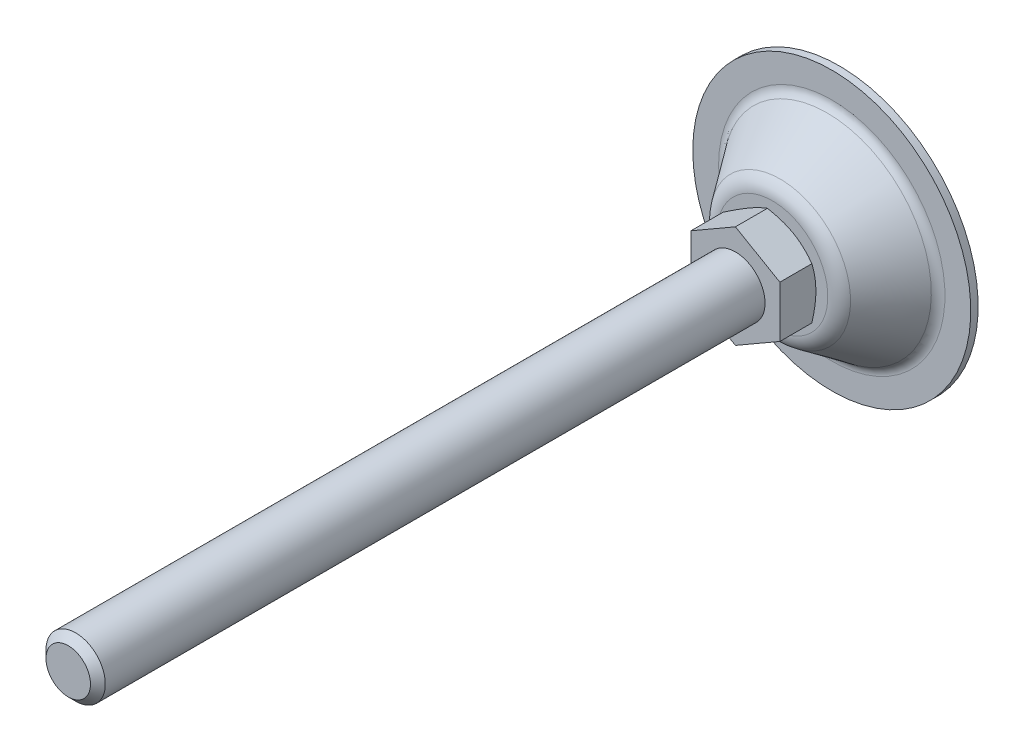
ISO-10303-21;
HEADER;
FILE_DESCRIPTION(('STEP AP214'),'2;1');
FILE_NAME('part.step','',(''),(''),'','','');
FILE_SCHEMA(('AUTOMOTIVE_DESIGN { 1 0 10303 214 1 1 1 1 }'));
ENDSEC;
DATA;
#1=APPLICATION_CONTEXT('core data for automotive mechanical design processes');
#2=APPLICATION_PROTOCOL_DEFINITION('international standard','automotive_design',2000,#1);
#3=PRODUCT_CONTEXT('',#1,'mechanical');
#4=PRODUCT('Part','Part','',(#3));
#5=PRODUCT_RELATED_PRODUCT_CATEGORY('part','',(#4));
#6=PRODUCT_DEFINITION_FORMATION('','',#4);
#7=PRODUCT_DEFINITION_CONTEXT('part definition',#1,'design');
#8=PRODUCT_DEFINITION('design','',#6,#7);
#9=PRODUCT_DEFINITION_SHAPE('','',#8);
#10=(LENGTH_UNIT() NAMED_UNIT(*) SI_UNIT(.MILLI.,.METRE.));
#11=(NAMED_UNIT(*) PLANE_ANGLE_UNIT() SI_UNIT($,.RADIAN.));
#12=(NAMED_UNIT(*) SI_UNIT($,.STERADIAN.) SOLID_ANGLE_UNIT());
#13=UNCERTAINTY_MEASURE_WITH_UNIT(LENGTH_MEASURE(1.E-05),#10,'distance_accuracy_value','');
#14=(GEOMETRIC_REPRESENTATION_CONTEXT(3) GLOBAL_UNCERTAINTY_ASSIGNED_CONTEXT((#13)) GLOBAL_UNIT_ASSIGNED_CONTEXT((#10,
#11,#12)) REPRESENTATION_CONTEXT('',''));
#15=CARTESIAN_POINT('',(0.,0.,0.));
#16=DIRECTION('',(0.,0.,1.));
#17=DIRECTION('',(1.,0.,0.));
#18=AXIS2_PLACEMENT_3D('',#15,#16,#17);
#19=CARTESIAN_POINT('',(0.,0.,28.));
#20=DIRECTION('',(0.,0.,1.));
#21=DIRECTION('',(0.5,-0.866025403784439,0.));
#22=AXIS2_PLACEMENT_3D('',#19,#20,#21);
#23=PLANE('',#22);
#24=DIRECTION('',(0.,1.,0.));
#25=VECTOR('',#24,1.);
#26=CARTESIAN_POINT('',(12.,-6.92820323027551,28.));
#27=LINE('',#26,#25);
#28=CARTESIAN_POINT('',(12.,-6.92820323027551,28.));
#29=VERTEX_POINT('',#28);
#30=CARTESIAN_POINT('',(12.,6.9282032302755,28.));
#31=VERTEX_POINT('',#30);
#32=EDGE_CURVE('E220',#29,#31,#27,.T.);
#33=ORIENTED_EDGE('',*,*,#32,.T.);
#34=DIRECTION('',(-0.866025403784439,0.5,0.));
#35=VECTOR('',#34,1.);
#36=CARTESIAN_POINT('',(12.,6.9282032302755,28.));
#37=LINE('',#36,#35);
#38=CARTESIAN_POINT('',(0.,13.856406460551,28.));
#39=VERTEX_POINT('',#38);
#40=EDGE_CURVE('E361',#31,#39,#37,.T.);
#41=ORIENTED_EDGE('',*,*,#40,.T.);
#42=DIRECTION('',(-0.866025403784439,-0.5,0.));
#43=VECTOR('',#42,1.);
#44=CARTESIAN_POINT('',(0.,13.856406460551,28.));
#45=LINE('',#44,#43);
#46=CARTESIAN_POINT('',(-12.,6.92820323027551,28.));
#47=VERTEX_POINT('',#46);
#48=EDGE_CURVE('E360',#39,#47,#45,.T.);
#49=ORIENTED_EDGE('',*,*,#48,.T.);
#50=DIRECTION('',(0.,-1.,0.));
#51=VECTOR('',#50,1.);
#52=CARTESIAN_POINT('',(-12.,6.92820323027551,28.));
#53=LINE('',#52,#51);
#54=CARTESIAN_POINT('',(-12.,-6.9282032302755,28.));
#55=VERTEX_POINT('',#54);
#56=EDGE_CURVE('E365',#47,#55,#53,.T.);
#57=ORIENTED_EDGE('',*,*,#56,.T.);
#58=DIRECTION('',(0.866025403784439,-0.5,0.));
#59=VECTOR('',#58,1.);
#60=CARTESIAN_POINT('',(-12.,-6.9282032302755,28.));
#61=LINE('',#60,#59);
#62=CARTESIAN_POINT('',(0.,-13.856406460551,28.));
#63=VERTEX_POINT('',#62);
#64=EDGE_CURVE('E367',#55,#63,#61,.T.);
#65=ORIENTED_EDGE('',*,*,#64,.T.);
#66=DIRECTION('',(0.866025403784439,0.5,0.));
#67=VECTOR('',#66,1.);
#68=CARTESIAN_POINT('',(0.,-13.856406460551,28.));
#69=LINE('',#68,#67);
#70=EDGE_CURVE('E37',#63,#29,#69,.T.);
#71=ORIENTED_EDGE('',*,*,#70,.T.);
#72=EDGE_LOOP('',(#33,#41,#49,#57,#65,#71));
#73=FACE_BOUND('',#72,.T.);
#74=CARTESIAN_POINT('',(0.,0.,28.));
#75=DIRECTION('',(0.,0.,1.));
#76=DIRECTION('',(0.5,-0.866025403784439,0.));
#77=AXIS2_PLACEMENT_3D('',#74,#75,#76);
#78=CIRCLE('',#77,8.);
#79=CARTESIAN_POINT('',(4.,-6.92820323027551,28.));
#80=VERTEX_POINT('',#79);
#81=EDGE_CURVE('E224',#80,#80,#78,.T.);
#82=ORIENTED_EDGE('',*,*,#81,.F.);
#83=EDGE_LOOP('',(#82));
#84=FACE_BOUND('',#83,.T.);
#85=ADVANCED_FACE('F14',(#73,#84),#23,.T.);
#86=CARTESIAN_POINT('',(-7.46811554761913,12.9351555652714,18.));
#87=DIRECTION('',(0.,0.,-1.));
#88=DIRECTION('',(-0.5,0.866025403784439,0.));
#89=AXIS2_PLACEMENT_3D('',#86,#87,#88);
#90=PLANE('',#89);
#91=CARTESIAN_POINT('',(-1.37317446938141E-13,2.37840794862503E-13,18.));
#92=DIRECTION('',(0.,0.,1.));
#93=DIRECTION('',(0.5,-0.866025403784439,0.));
#94=AXIS2_PLACEMENT_3D('',#91,#92,#93);
#95=CIRCLE('',#94,14.936231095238);
#96=CARTESIAN_POINT('',(7.46811554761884,-12.9351555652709,18.));
#97=VERTEX_POINT('',#96);
#98=EDGE_CURVE('E111',#97,#97,#95,.T.);
#99=ORIENTED_EDGE('',*,*,#98,.T.);
#100=EDGE_LOOP('',(#99));
#101=FACE_BOUND('',#100,.T.);
#102=CARTESIAN_POINT('',(0.,0.,18.));
#103=DIRECTION('',(0.,0.,-1.));
#104=DIRECTION('',(-0.5,0.866025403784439,0.));
#105=AXIS2_PLACEMENT_3D('',#102,#103,#104);
#106=CIRCLE('',#105,11.5);
#107=CARTESIAN_POINT('',(-5.75,9.95929214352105,18.));
#108=VERTEX_POINT('',#107);
#109=EDGE_CURVE('E84',#108,#108,#106,.T.);
#110=ORIENTED_EDGE('',*,*,#109,.T.);
#111=EDGE_LOOP('',(#110));
#112=FACE_BOUND('',#111,.T.);
#113=ADVANCED_FACE('F195',(#101,#112),#90,.F.);
#114=CARTESIAN_POINT('',(-1.54390389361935E-13,2.67411998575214E-13,4.9999999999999));
#115=DIRECTION('',(0.,0.,1.));
#116=DIRECTION('',(0.5,-0.866025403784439,0.));
#117=AXIS2_PLACEMENT_3D('',#114,#115,#116);
#118=TOROIDAL_SURFACE('',#117,30.5382613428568,3.);
#119=CARTESIAN_POINT('',(-1.55741344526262E-13,2.69751921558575E-13,3.24909185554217));
#120=DIRECTION('',(0.,0.,1.));
#121=DIRECTION('',(0.5,-0.866025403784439,0.));
#122=AXIS2_PLACEMENT_3D('',#119,#120,#121);
#123=CIRCLE('',#122,28.1022152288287);
#124=CARTESIAN_POINT('',(14.0511076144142,-24.3372322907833,3.2490918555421));
#125=VERTEX_POINT('',#124);
#126=EDGE_CURVE('E73',#125,#125,#123,.T.);
#127=ORIENTED_EDGE('',*,*,#126,.F.);
#128=EDGE_LOOP('',(#127));
#129=FACE_BOUND('',#128,.T.);
#130=CARTESIAN_POINT('',(-1.57301461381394E-13,2.72454123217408E-13,1.99999999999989));
#131=DIRECTION('',(0.,0.,1.));
#132=DIRECTION('',(0.5,-0.866025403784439,0.));
#133=AXIS2_PLACEMENT_3D('',#130,#131,#132);
#134=CIRCLE('',#133,30.5382613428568);
#135=CARTESIAN_POINT('',(15.2691306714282,-26.446910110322,1.99999999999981));
#136=VERTEX_POINT('',#135);
#137=EDGE_CURVE('E102',#136,#136,#134,.T.);
#138=ORIENTED_EDGE('',*,*,#137,.T.);
#139=EDGE_LOOP('',(#138));
#140=FACE_BOUND('',#139,.T.);
#141=ADVANCED_FACE('F198',(#129,#140),#118,.F.);
#142=CARTESIAN_POINT('',(-1.55741344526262E-13,2.69751921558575E-13,3.24909185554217));
#143=DIRECTION('',(0.,0.,-1.));
#144=DIRECTION('',(-0.5,0.866025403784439,0.));
#145=AXIS2_PLACEMENT_3D('',#142,#143,#144);
#146=CONICAL_SURFACE('',#145,28.1022152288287,0.623199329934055);
#147=CARTESIAN_POINT('',(-1.39917641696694E-13,2.42344464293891E-13,15.9181802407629));
#148=DIRECTION('',(0.,0.,1.));
#149=DIRECTION('',(0.5,-0.866025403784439,0.));
#150=AXIS2_PLACEMENT_3D('',#147,#148,#149);
#151=CIRCLE('',#150,18.9963079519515);
#152=CARTESIAN_POINT('',(9.49815397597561,-16.4512852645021,15.9181802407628));
#153=VERTEX_POINT('',#152);
#154=EDGE_CURVE('E114',#153,#153,#151,.T.);
#155=ORIENTED_EDGE('',*,*,#154,.F.);
#156=EDGE_LOOP('',(#155));
#157=FACE_BOUND('',#156,.T.);
#158=ORIENTED_EDGE('',*,*,#126,.T.);
#159=EDGE_LOOP('',(#158));
#160=FACE_BOUND('',#159,.T.);
#161=ADVANCED_FACE('F202',(#157,#160),#146,.T.);
#162=CARTESIAN_POINT('',(-1.43982048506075E-13,2.49384223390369E-13,13.));
#163=DIRECTION('',(0.,0.,1.));
#164=DIRECTION('',(0.5,-0.866025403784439,0.));
#165=AXIS2_PLACEMENT_3D('',#162,#163,#164);
#166=TOROIDAL_SURFACE('',#165,14.9362310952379,5.);
#167=ORIENTED_EDGE('',*,*,#98,.F.);
#168=EDGE_LOOP('',(#167));
#169=FACE_BOUND('',#168,.T.);
#170=ORIENTED_EDGE('',*,*,#154,.T.);
#171=EDGE_LOOP('',(#170));
#172=FACE_BOUND('',#171,.T.);
#173=ADVANCED_FACE('F193',(#169,#172),#166,.T.);
#174=CARTESIAN_POINT('',(-18.75,32.4759526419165,0.));
#175=DIRECTION('',(0.,0.,1.));
#176=DIRECTION('',(0.5,-0.866025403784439,0.));
#177=AXIS2_PLACEMENT_3D('',#174,#175,#176);
#178=PLANE('',#177);
#179=CARTESIAN_POINT('',(-1.59799463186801E-13,2.76780789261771E-13,-1.38777878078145E-13));
#180=DIRECTION('',(0.,0.,1.));
#181=DIRECTION('',(0.5,-0.866025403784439,0.));
#182=AXIS2_PLACEMENT_3D('',#179,#180,#181);
#183=CIRCLE('',#182,37.5);
#184=CARTESIAN_POINT('',(18.7499999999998,-32.4759526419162,-2.32452945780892E-13));
#185=VERTEX_POINT('',#184);
#186=EDGE_CURVE('E108',#185,#185,#183,.T.);
#187=ORIENTED_EDGE('',*,*,#186,.F.);
#188=EDGE_LOOP('',(#187));
#189=FACE_BOUND('',#188,.T.);
#190=ADVANCED_FACE('F189',(#189),#178,.F.);
#191=CARTESIAN_POINT('',(0.,0.,129.670029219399));
#192=DIRECTION('',(0.,0.,1.));
#193=DIRECTION('',(0.5,-0.866025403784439,0.));
#194=AXIS2_PLACEMENT_3D('',#191,#192,#193);
#195=CYLINDRICAL_SURFACE('',#194,37.5);
#196=CARTESIAN_POINT('',(-1.57301461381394E-13,2.72454123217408E-13,1.99999999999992));
#197=DIRECTION('',(0.,0.,1.));
#198=DIRECTION('',(0.5,-0.866025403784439,0.));
#199=AXIS2_PLACEMENT_3D('',#196,#197,#198);
#200=CIRCLE('',#199,37.5);
#201=CARTESIAN_POINT('',(18.7499999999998,-32.4759526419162,1.99999999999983));
#202=VERTEX_POINT('',#201);
#203=EDGE_CURVE('E105',#202,#202,#200,.T.);
#204=ORIENTED_EDGE('',*,*,#203,.F.);
#205=EDGE_LOOP('',(#204));
#206=FACE_BOUND('',#205,.T.);
#207=ORIENTED_EDGE('',*,*,#186,.T.);
#208=EDGE_LOOP('',(#207));
#209=FACE_BOUND('',#208,.T.);
#210=ADVANCED_FACE('F185',(#206,#209),#195,.T.);
#211=CARTESIAN_POINT('',(-18.75,32.4759526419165,2.));
#212=DIRECTION('',(0.,0.,-1.));
#213=DIRECTION('',(-0.5,0.866025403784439,0.));
#214=AXIS2_PLACEMENT_3D('',#211,#212,#213);
#215=PLANE('',#214);
#216=ORIENTED_EDGE('',*,*,#137,.F.);
#217=EDGE_LOOP('',(#216));
#218=FACE_BOUND('',#217,.T.);
#219=ORIENTED_EDGE('',*,*,#203,.T.);
#220=EDGE_LOOP('',(#219));
#221=FACE_BOUND('',#220,.T.);
#222=ADVANCED_FACE('F130',(#218,#221),#215,.F.);
#223=CARTESIAN_POINT('',(0.,0.,23.6283876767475));
#224=DIRECTION('',(0.,0.,1.));
#225=DIRECTION('',(0.5,-0.866025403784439,0.));
#226=AXIS2_PLACEMENT_3D('',#223,#224,#225);
#227=CONICAL_SURFACE('',#226,21.2486534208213,1.0471975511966);
#228=ORIENTED_EDGE('',*,*,#109,.F.);
#229=EDGE_LOOP('',(#228));
#230=FACE_BOUND('',#229,.T.);
#231=CARTESIAN_POINT('',(-10.0532557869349,-19.6606563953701,24.1094504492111));
#232=CARTESIAN_POINT('',(-9.82653838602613,-19.5297610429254,23.9825738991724));
#233=CARTESIAN_POINT('',(-9.59955317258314,-19.398711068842,23.856335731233));
#234=CARTESIAN_POINT('',(-9.14499119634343,-19.1362695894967,23.6052809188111));
#235=CARTESIAN_POINT('',(-8.91741442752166,-19.0048780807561,23.4804642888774));
#236=CARTESIAN_POINT('',(-8.23365135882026,-18.6101072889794,23.1083304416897));
#237=CARTESIAN_POINT('',(-7.77650041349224,-18.346171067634,22.8633674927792));
#238=CARTESIAN_POINT('',(-6.85659953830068,-17.8150660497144,22.3798814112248));
#239=CARTESIAN_POINT('',(-6.39383263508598,-17.5478874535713,22.1414012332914));
#240=CARTESIAN_POINT('',(-5.46459534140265,-17.0113920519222,21.6742979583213));
#241=CARTESIAN_POINT('',(-4.9981251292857,-16.7420753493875,21.4456743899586));
#242=CARTESIAN_POINT('',(-4.04609504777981,-16.1924205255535,20.9939474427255));
#243=CARTESIAN_POINT('',(-3.56039382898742,-15.912000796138,20.7712391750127));
#244=CARTESIAN_POINT('',(-2.58328268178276,-15.3478654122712,20.3428555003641));
#245=CARTESIAN_POINT('',(-2.09187211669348,-15.0641493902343,20.137182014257));
#246=CARTESIAN_POINT('',(-1.10351639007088,-14.4935219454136,19.7483225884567));
#247=CARTESIAN_POINT('',(-0.606584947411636,-14.2066184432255,19.565090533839));
#248=CARTESIAN_POINT('',(0.394451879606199,-13.628669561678,19.2270309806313));
#249=CARTESIAN_POINT('',(0.898554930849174,-13.3376255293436,19.072194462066));
#250=CARTESIAN_POINT('',(1.65882416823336,-12.8986838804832,18.8672836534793));
#251=CARTESIAN_POINT('',(1.91226998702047,-12.7523568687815,18.8036673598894));
#252=CARTESIAN_POINT('',(2.42088138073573,-12.4587099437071,18.6863216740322));
#253=CARTESIAN_POINT('',(2.6760469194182,-12.3113900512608,18.6325920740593));
#254=CARTESIAN_POINT('',(3.18791661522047,-12.0158619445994,18.5359727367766));
#255=CARTESIAN_POINT('',(3.44462075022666,-11.8676537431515,18.4930828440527));
#256=CARTESIAN_POINT('',(3.95929088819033,-11.5705088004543,18.4190010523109));
#257=CARTESIAN_POINT('',(4.2172568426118,-11.4215720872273,18.3878087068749));
#258=CARTESIAN_POINT('',(4.73074751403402,-11.1251081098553,18.3381289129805));
#259=CARTESIAN_POINT('',(4.98626060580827,-10.977587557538,18.319482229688));
#260=CARTESIAN_POINT('',(5.49773994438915,-10.6822848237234,18.294677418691));
#261=CARTESIAN_POINT('',(5.75370618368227,-10.534502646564,18.2885190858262));
#262=CARTESIAN_POINT('',(6.26563805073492,-10.2389386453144,18.2888371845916));
#263=CARTESIAN_POINT('',(6.5216036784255,-10.091156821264,18.295313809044));
#264=CARTESIAN_POINT('',(7.03307268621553,-9.79586005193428,18.3207453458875));
#265=CARTESIAN_POINT('',(7.28857604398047,-9.64834511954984,18.3397008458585));
#266=CARTESIAN_POINT('',(7.90442793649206,-9.29278286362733,18.4000305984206));
#267=CARTESIAN_POINT('',(8.26434066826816,-9.08498715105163,18.4474404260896));
#268=CARTESIAN_POINT('',(8.98145632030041,-8.67096023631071,18.5644233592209));
#269=CARTESIAN_POINT('',(9.33865885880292,-8.46472925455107,18.6339995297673));
#270=CARTESIAN_POINT('',(10.0500214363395,-8.0540238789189,18.7928402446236));
#271=CARTESIAN_POINT('',(10.4041788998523,-7.84955097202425,18.8821200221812));
#272=CARTESIAN_POINT('',(11.1089234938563,-7.44266649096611,19.077650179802));
#273=CARTESIAN_POINT('',(11.4595106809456,-7.24025488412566,19.1839002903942));
#274=CARTESIAN_POINT('',(12.1650627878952,-6.83290418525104,19.4133803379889));
#275=CARTESIAN_POINT('',(12.5199465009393,-6.62801197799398,19.5369408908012));
#276=CARTESIAN_POINT('',(13.2262157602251,-6.22024723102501,19.7966751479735));
#277=CARTESIAN_POINT('',(13.5776012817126,-6.01737470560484,19.9328489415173));
#278=CARTESIAN_POINT('',(14.2770536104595,-5.61354571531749,20.2156602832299));
#279=CARTESIAN_POINT('',(14.6251214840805,-5.41258863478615,20.3622943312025));
#280=CARTESIAN_POINT('',(15.318378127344,-5.01233672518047,20.664315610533));
#281=CARTESIAN_POINT('',(15.6635669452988,-4.81304186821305,20.8197026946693));
#282=CARTESIAN_POINT('',(16.5374507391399,-4.30850482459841,21.2238005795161));
#283=CARTESIAN_POINT('',(17.0644049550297,-4.00426766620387,21.477525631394));
#284=CARTESIAN_POINT('',(18.1134107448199,-3.39862389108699,21.9981888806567));
#285=CARTESIAN_POINT('',(18.635461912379,-3.097217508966,22.2651281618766));
#286=CARTESIAN_POINT('',(19.6756923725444,-2.49664017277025,22.8093074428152));
#287=CARTESIAN_POINT('',(20.1938705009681,-2.19746989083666,23.0865504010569));
#288=CARTESIAN_POINT('',(21.226926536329,-1.60103471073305,23.6490491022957));
#289=CARTESIAN_POINT('',(21.7418045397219,-1.30376975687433,23.9343046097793));
#290=CARTESIAN_POINT('',(22.7695382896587,-0.710407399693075,24.5115723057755));
#291=CARTESIAN_POINT('',(23.2823905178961,-0.414312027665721,24.8035928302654));
#292=CARTESIAN_POINT('',(24.3058697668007,0.176593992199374,25.3927886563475));
#293=CARTESIAN_POINT('',(24.8164967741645,0.471404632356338,25.689963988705));
#294=CARTESIAN_POINT('',(25.835813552,1.05990744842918,26.2884658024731));
#295=CARTESIAN_POINT('',(26.3445036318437,1.35359980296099,26.5897915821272));
#296=CARTESIAN_POINT('',(27.3603325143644,1.94008888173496,27.1959115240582));
#297=CARTESIAN_POINT('',(27.8674713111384,2.23288560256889,27.5007056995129));
#298=CARTESIAN_POINT('',(29.2909254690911,3.05471724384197,28.3613531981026));
#299=CARTESIAN_POINT('',(30.2057559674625,3.58289487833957,28.9204806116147));
#300=CARTESIAN_POINT('',(32.0322611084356,4.63742811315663,30.0456673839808));
#301=CARTESIAN_POINT('',(32.9439356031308,5.16378362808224,30.6117270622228));
#302=CARTESIAN_POINT('',(34.7622656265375,6.2135969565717,31.7474746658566));
#303=CARTESIAN_POINT('',(35.6689280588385,6.73705875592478,32.3171478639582));
#304=CARTESIAN_POINT('',(37.0274616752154,7.52140850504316,33.174659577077));
#305=CARTESIAN_POINT('',(37.4800486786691,7.78270973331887,33.4609880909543));
#306=CARTESIAN_POINT('',(38.3847950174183,8.30506527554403,34.0345430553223));
#307=CARTESIAN_POINT('',(38.8369543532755,8.5661195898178,34.3217695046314));
#308=CARTESIAN_POINT('',(39.2889251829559,8.82706506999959,34.6093910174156));
#309=B_SPLINE_CURVE_WITH_KNOTS('',3,(#231,#232,#233,#234,#235,#236,#237,#238,#239,#240,#241,
#242,#243,#244,#245,#246,#247,#248,#249,#250,#251,#252,#253,#254,#255,#256,#257,#258,#259,#260,
#261,#262,#263,#264,#265,#266,#267,#268,#269,#270,#271,#272,#273,#274,#275,#276,#277,#278,#279,
#280,#281,#282,#283,#284,#285,#286,#287,#288,#289,#290,#291,#292,#293,#294,#295,#296,#297,#298,
#299,#300,#301,#302,#303,#304,#305,#306,#307,#308),.UNSPECIFIED.,.F.,.F.,(4,2,2,2,2,2,2,2,2,2,2,
2,2,2,2,2,2,2,2,2,2,2,2,2,2,2,2,2,2,2,2,2,2,2,2,2,2,2,4),(0.,0.872745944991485,1.74550081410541,
3.49127289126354,5.24667070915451,7.00198449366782,8.81209333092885,10.6224059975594,
12.4289339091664,14.2348869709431,15.1332127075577,16.0315195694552,16.929813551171,
17.8280732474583,18.7147052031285,19.6013225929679,20.4879535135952,21.3746261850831,
22.6287917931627,23.88313089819,25.1384431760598,26.3937355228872,27.6775150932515,
28.9613037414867,30.2446648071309,31.5280042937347,33.5055452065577,35.4832485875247,
37.4615242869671,39.439741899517,41.4205425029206,43.4013549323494,45.3818364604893,
47.3623255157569,50.9478944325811,54.5336291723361,58.1092552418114,59.8969559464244,
61.6846542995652),.UNSPECIFIED.);
#310=CARTESIAN_POINT('',(0.,-13.856406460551,19.3604719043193));
#311=VERTEX_POINT('',#310);
#312=CARTESIAN_POINT('',(12.,-6.92820323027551,19.3604719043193));
#313=VERTEX_POINT('',#312);
#314=EDGE_CURVE('E65',#311,#313,#309,.T.);
#315=ORIENTED_EDGE('',*,*,#314,.F.);
#316=CARTESIAN_POINT('',(-12.0002,-6.92808776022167,19.3605385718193));
#317=CARTESIAN_POINT('',(-11.7364142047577,-7.08038456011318,19.2726247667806));
#318=CARTESIAN_POINT('',(-11.4716448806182,-7.2332492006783,19.1887011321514));
#319=CARTESIAN_POINT('',(-10.9399829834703,-7.54020434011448,19.0299413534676));
#320=CARTESIAN_POINT('',(-10.6730897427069,-7.69429522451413,18.9551081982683));
#321=CARTESIAN_POINT('',(-9.86810959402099,-8.15905073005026,18.7456926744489));
#322=CARTESIAN_POINT('',(-9.32684492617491,-8.47155003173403,18.6265783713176));
#323=CARTESIAN_POINT('',(-8.51686717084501,-8.93919090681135,18.4869061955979));
#324=CARTESIAN_POINT('',(-8.25057389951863,-9.09293539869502,18.4471189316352));
#325=CARTESIAN_POINT('',(-7.71675440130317,-9.40113622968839,18.3803985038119));
#326=CARTESIAN_POINT('',(-7.44922815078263,-9.55559258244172,18.3534655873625));
#327=CARTESIAN_POINT('',(-6.91372963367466,-9.86476279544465,18.3131437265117));
#328=CARTESIAN_POINT('',(-6.64575827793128,-10.0194761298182,18.2997386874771));
#329=CARTESIAN_POINT('',(-6.10956726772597,-10.3290461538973,18.2867582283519));
#330=CARTESIAN_POINT('',(-5.84134762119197,-10.4839028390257,18.2871823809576));
#331=CARTESIAN_POINT('',(-5.3399106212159,-10.7734076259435,18.3008951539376));
#332=CARTESIAN_POINT('',(-5.10665750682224,-10.908076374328,18.3125111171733));
#333=CARTESIAN_POINT('',(-4.64068775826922,-11.1771041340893,18.3459831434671));
#334=CARTESIAN_POINT('',(-4.40797116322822,-11.3114631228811,18.367839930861));
#335=CARTESIAN_POINT('',(-3.94320092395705,-11.5797983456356,18.4214125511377));
#336=CARTESIAN_POINT('',(-3.71114798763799,-11.7137741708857,18.4531365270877));
#337=CARTESIAN_POINT('',(-3.24813003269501,-11.9810977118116,18.5258869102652));
#338=CARTESIAN_POINT('',(-3.01716508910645,-12.1144453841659,18.566913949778));
#339=CARTESIAN_POINT('',(-2.31605804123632,-12.5192297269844,18.7049867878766));
#340=CARTESIAN_POINT('',(-1.84794625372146,-12.789494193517,18.8158000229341));
#341=CARTESIAN_POINT('',(-0.918702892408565,-13.3259930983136,19.0673009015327));
#342=CARTESIAN_POINT('',(-0.457559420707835,-13.5922344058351,19.2079294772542));
#343=CARTESIAN_POINT('',(0.000199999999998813,-13.8565219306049,19.3605385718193));
#344=B_SPLINE_CURVE_WITH_KNOTS('',3,(#316,#317,#318,#319,#320,#321,#322,#323,#324,#325,#326,
#327,#328,#329,#330,#331,#332,#333,#334,#335,#336,#337,#338,#339,#340,#341,#342,#343),
.UNSPECIFIED.,.F.,.F.,(4,2,2,2,2,2,2,2,2,2,2,2,2,4),(0.,0.951004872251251,1.90232158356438,
3.80900466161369,4.73894551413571,5.6689042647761,6.59775529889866,7.52657763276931,
8.3351464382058,9.14377244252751,9.95306755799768,10.7624176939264,12.4167102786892,
14.0677556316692),.UNSPECIFIED.);
#345=CARTESIAN_POINT('',(-12.,-6.9282032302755,19.3604719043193));
#346=VERTEX_POINT('',#345);
#347=EDGE_CURVE('E68',#346,#311,#344,.T.);
#348=ORIENTED_EDGE('',*,*,#347,.F.);
#349=CARTESIAN_POINT('',(-12.,6.92843417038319,19.3605385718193));
#350=CARTESIAN_POINT('',(-12.,6.62384057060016,19.2726247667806));
#351=CARTESIAN_POINT('',(-12.,6.31811128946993,19.1887011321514));
#352=CARTESIAN_POINT('',(-12.,5.70420101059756,19.0299413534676));
#353=CARTESIAN_POINT('',(-12.,5.39601924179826,18.9551081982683));
#354=CARTESIAN_POINT('',(-12.,4.466508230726,18.7456926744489));
#355=CARTESIAN_POINT('',(-12.,3.84150962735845,18.6265783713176));
#356=CARTESIAN_POINT('',(-12.,2.9062278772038,18.4869061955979));
#357=CARTESIAN_POINT('',(-12.,2.59873889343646,18.4471189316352));
#358=CARTESIAN_POINT('',(-12.,1.98233723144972,18.3803985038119));
#359=CARTESIAN_POINT('',(-12.,1.67342452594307,18.3534655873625));
#360=CARTESIAN_POINT('',(-12.,1.05508409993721,18.3131437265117));
#361=CARTESIAN_POINT('',(-12.,0.745657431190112,18.2997386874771));
#362=CARTESIAN_POINT('',(-12.,0.126517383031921,18.2867582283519));
#363=CARTESIAN_POINT('',(-12.,-0.183195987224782,18.2871823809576));
#364=CARTESIAN_POINT('',(-12.,-0.762205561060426,18.3008951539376));
#365=CARTESIAN_POINT('',(-12.,-1.03154305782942,18.3125111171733));
#366=CARTESIAN_POINT('',(-12.,-1.56959857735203,18.3459831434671));
#367=CARTESIAN_POINT('',(-12.,-1.83831655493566,18.367839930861));
#368=CARTESIAN_POINT('',(-12.,-2.37498700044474,18.4214125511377));
#369=CARTESIAN_POINT('',(-12.,-2.64293865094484,18.4531365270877));
#370=CARTESIAN_POINT('',(-12.,-3.17758573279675,18.5258869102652));
#371=CARTESIAN_POINT('',(-12.,-3.4442810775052,18.566913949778));
#372=CARTESIAN_POINT('',(-12.,-4.25384976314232,18.7049867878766));
#373=CARTESIAN_POINT('',(-12.,-4.79437869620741,18.8158000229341));
#374=CARTESIAN_POINT('',(-12.,-5.86737650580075,19.0673009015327));
#375=CARTESIAN_POINT('',(-12.,-6.39985912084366,19.2079294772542));
#376=CARTESIAN_POINT('',(-12.,-6.92843417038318,19.3605385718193));
#377=B_SPLINE_CURVE_WITH_KNOTS('',3,(#349,#350,#351,#352,#353,#354,#355,#356,#357,#358,#359,
#360,#361,#362,#363,#364,#365,#366,#367,#368,#369,#370,#371,#372,#373,#374,#375,#376),
.UNSPECIFIED.,.F.,.F.,(4,2,2,2,2,2,2,2,2,2,2,2,2,4),(0.,0.951004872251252,1.90232158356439,
3.80900466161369,4.73894551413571,5.6689042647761,6.59775529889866,7.52657763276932,
8.3351464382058,9.14377244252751,9.95306755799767,10.7624176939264,12.4167102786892,
14.0677556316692),.UNSPECIFIED.);
#378=CARTESIAN_POINT('',(-12.,6.92820323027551,19.3604719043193));
#379=VERTEX_POINT('',#378);
#380=EDGE_CURVE('E83',#379,#346,#377,.T.);
#381=ORIENTED_EDGE('',*,*,#380,.F.);
#382=CARTESIAN_POINT('',(-22.0532557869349,1.12395329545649,24.1094504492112));
#383=CARTESIAN_POINT('',(-21.8265383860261,1.25484864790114,23.9825738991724));
#384=CARTESIAN_POINT('',(-21.5995531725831,1.38589862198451,23.856335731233));
#385=CARTESIAN_POINT('',(-21.1449911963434,1.64834010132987,23.6052809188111));
#386=CARTESIAN_POINT('',(-20.9174144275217,1.77973161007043,23.4804642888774));
#387=CARTESIAN_POINT('',(-20.2336513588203,2.1745024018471,23.1083304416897));
#388=CARTESIAN_POINT('',(-19.7765004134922,2.43843862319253,22.8633674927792));
#389=CARTESIAN_POINT('',(-18.8565995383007,2.96954364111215,22.3798814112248));
#390=CARTESIAN_POINT('',(-18.393832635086,3.23672223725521,22.1414012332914));
#391=CARTESIAN_POINT('',(-17.4645953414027,3.77321763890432,21.6742979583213));
#392=CARTESIAN_POINT('',(-16.9981251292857,4.04253434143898,21.4456743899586));
#393=CARTESIAN_POINT('',(-16.0460950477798,4.59218916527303,20.9939474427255));
#394=CARTESIAN_POINT('',(-15.5603938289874,4.87260889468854,20.7712391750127));
#395=CARTESIAN_POINT('',(-14.5832826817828,5.43674427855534,20.3428555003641));
#396=CARTESIAN_POINT('',(-14.0918721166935,5.72046030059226,20.137182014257));
#397=CARTESIAN_POINT('',(-13.1035163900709,6.29108774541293,19.7483225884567));
#398=CARTESIAN_POINT('',(-12.6065849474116,6.57799124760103,19.565090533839));
#399=CARTESIAN_POINT('',(-11.6055481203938,7.1559401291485,19.2270309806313));
#400=CARTESIAN_POINT('',(-11.1014450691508,7.44698416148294,19.072194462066));
#401=CARTESIAN_POINT('',(-10.3411758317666,7.8859258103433,18.8672836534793));
#402=CARTESIAN_POINT('',(-10.0877300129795,8.03225282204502,18.8036673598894));
#403=CARTESIAN_POINT('',(-9.57911861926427,8.32589974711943,18.6863216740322));
#404=CARTESIAN_POINT('',(-9.3239530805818,8.47321963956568,18.6325920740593));
#405=CARTESIAN_POINT('',(-8.81208338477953,8.76874774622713,18.5359727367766));
#406=CARTESIAN_POINT('',(-8.55537924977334,8.91695594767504,18.4930828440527));
#407=CARTESIAN_POINT('',(-8.04070911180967,9.21410089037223,18.4190010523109));
#408=CARTESIAN_POINT('',(-7.78274315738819,9.36303760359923,18.3878087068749));
#409=CARTESIAN_POINT('',(-7.26925248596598,9.6595015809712,18.3381289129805));
#410=CARTESIAN_POINT('',(-7.01373939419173,9.80702213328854,18.319482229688));
#411=CARTESIAN_POINT('',(-6.50226005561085,10.1023248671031,18.294677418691));
#412=CARTESIAN_POINT('',(-6.24629381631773,10.2501070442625,18.2885190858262));
#413=CARTESIAN_POINT('',(-5.73436194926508,10.5456710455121,18.2888371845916));
#414=CARTESIAN_POINT('',(-5.4783963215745,10.6934528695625,18.295313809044));
#415=CARTESIAN_POINT('',(-4.96692731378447,10.9887496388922,18.3207453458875));
#416=CARTESIAN_POINT('',(-4.71142395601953,11.1362645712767,18.3397008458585));
#417=CARTESIAN_POINT('',(-4.09557206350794,11.4918268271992,18.4000305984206));
#418=CARTESIAN_POINT('',(-3.73565933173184,11.6996225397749,18.4474404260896));
#419=CARTESIAN_POINT('',(-3.01854367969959,12.1136494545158,18.5644233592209));
#420=CARTESIAN_POINT('',(-2.66134114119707,12.3198804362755,18.6339995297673));
#421=CARTESIAN_POINT('',(-1.9499785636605,12.7305858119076,18.7928402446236));
#422=CARTESIAN_POINT('',(-1.59582110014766,12.9350587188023,18.8821200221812));
#423=CARTESIAN_POINT('',(-0.891076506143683,13.3419431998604,19.077650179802));
#424=CARTESIAN_POINT('',(-0.540489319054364,13.5443548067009,19.1839002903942));
#425=CARTESIAN_POINT('',(0.165062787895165,13.9517055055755,19.4133803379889));
#426=CARTESIAN_POINT('',(0.519946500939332,14.1565977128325,19.5369408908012));
#427=CARTESIAN_POINT('',(1.22621576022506,14.5643624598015,19.7966751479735));
#428=CARTESIAN_POINT('',(1.57760128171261,14.7672349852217,19.9328489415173));
#429=CARTESIAN_POINT('',(2.27705361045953,15.171063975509,20.2156602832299));
#430=CARTESIAN_POINT('',(2.62512148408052,15.3720210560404,20.3622943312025));
#431=CARTESIAN_POINT('',(3.31837812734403,15.7722729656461,20.664315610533));
#432=CARTESIAN_POINT('',(3.66356694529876,15.9715678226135,20.8197026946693));
#433=CARTESIAN_POINT('',(4.53745073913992,16.4761048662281,21.2238005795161));
#434=CARTESIAN_POINT('',(5.06440495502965,16.7803420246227,21.477525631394));
#435=CARTESIAN_POINT('',(6.1134107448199,17.3859857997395,21.9981888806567));
#436=CARTESIAN_POINT('',(6.63546191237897,17.6873921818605,22.2651281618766));
#437=CARTESIAN_POINT('',(7.67569237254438,18.2879695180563,22.8093074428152));
#438=CARTESIAN_POINT('',(8.19387050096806,18.5871397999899,23.0865504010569));
#439=CARTESIAN_POINT('',(9.22692653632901,19.1835749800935,23.6490491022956));
#440=CARTESIAN_POINT('',(9.74180453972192,19.4808399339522,23.9343046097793));
#441=CARTESIAN_POINT('',(10.7695382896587,20.0742022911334,24.5115723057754));
#442=CARTESIAN_POINT('',(11.2823905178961,20.3702976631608,24.8035928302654));
#443=CARTESIAN_POINT('',(12.3058697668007,20.9612036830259,25.3927886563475));
#444=CARTESIAN_POINT('',(12.8164967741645,21.2560143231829,25.689963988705));
#445=CARTESIAN_POINT('',(13.835813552,21.8445171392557,26.2884658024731));
#446=CARTESIAN_POINT('',(14.3445036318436,22.1382094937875,26.5897915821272));
#447=CARTESIAN_POINT('',(15.3603325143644,22.7246985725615,27.1959115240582));
#448=CARTESIAN_POINT('',(15.8674713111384,23.0174952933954,27.5007056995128));
#449=CARTESIAN_POINT('',(17.2909254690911,23.8393269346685,28.3613531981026));
#450=CARTESIAN_POINT('',(18.2057559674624,24.3675045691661,28.9204806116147));
#451=CARTESIAN_POINT('',(20.0322611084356,25.4220378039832,30.0456673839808));
#452=CARTESIAN_POINT('',(20.9439356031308,25.9483933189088,30.6117270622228));
#453=CARTESIAN_POINT('',(22.7622656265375,26.9982066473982,31.7474746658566));
#454=CARTESIAN_POINT('',(23.6689280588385,27.5216684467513,32.3171478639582));
#455=CARTESIAN_POINT('',(25.0274616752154,28.3060181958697,33.1746595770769));
#456=CARTESIAN_POINT('',(25.4800486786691,28.5673194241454,33.4609880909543));
#457=CARTESIAN_POINT('',(26.3847950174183,29.0896749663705,34.0345430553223));
#458=CARTESIAN_POINT('',(26.8369543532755,29.3507292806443,34.3217695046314));
#459=CARTESIAN_POINT('',(27.2889251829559,29.6116747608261,34.6093910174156));
#460=B_SPLINE_CURVE_WITH_KNOTS('',3,(#382,#383,#384,#385,#386,#387,#388,#389,#390,#391,#392,
#393,#394,#395,#396,#397,#398,#399,#400,#401,#402,#403,#404,#405,#406,#407,#408,#409,#410,#411,
#412,#413,#414,#415,#416,#417,#418,#419,#420,#421,#422,#423,#424,#425,#426,#427,#428,#429,#430,
#431,#432,#433,#434,#435,#436,#437,#438,#439,#440,#441,#442,#443,#444,#445,#446,#447,#448,#449,
#450,#451,#452,#453,#454,#455,#456,#457,#458,#459),.UNSPECIFIED.,.F.,.F.,(4,2,2,2,2,2,2,2,2,2,2,
2,2,2,2,2,2,2,2,2,2,2,2,2,2,2,2,2,2,2,2,2,2,2,2,2,2,2,4),(0.,0.872745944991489,1.74550081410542,
3.49127289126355,5.24667070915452,7.00198449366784,8.81209333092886,10.6224059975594,
12.4289339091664,14.2348869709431,15.1332127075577,16.0315195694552,16.9298135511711,
17.8280732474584,18.7147052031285,19.6013225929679,20.4879535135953,21.3746261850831,
22.6287917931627,23.88313089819,25.1384431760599,26.3937355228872,27.6775150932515,
28.9613037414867,30.244664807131,31.5280042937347,33.5055452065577,35.4832485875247,
37.4615242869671,39.439741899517,41.4205425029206,43.4013549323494,45.3818364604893,
47.3623255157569,50.9478944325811,54.5336291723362,58.1092552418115,59.8969559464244,
61.6846542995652),.UNSPECIFIED.);
#461=CARTESIAN_POINT('',(0.,13.856406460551,19.3604719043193));
#462=VERTEX_POINT('',#461);
#463=EDGE_CURVE('E152',#462,#379,#460,.F.);
#464=ORIENTED_EDGE('',*,*,#463,.F.);
#465=CARTESIAN_POINT('',(12.0002,6.92808776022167,19.3605385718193));
#466=CARTESIAN_POINT('',(11.7364142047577,7.08038456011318,19.2726247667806));
#467=CARTESIAN_POINT('',(11.4716448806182,7.2332492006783,19.1887011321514));
#468=CARTESIAN_POINT('',(10.9399829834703,7.54020434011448,19.0299413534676));
#469=CARTESIAN_POINT('',(10.6730897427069,7.69429522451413,18.9551081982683));
#470=CARTESIAN_POINT('',(9.86810959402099,8.15905073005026,18.7456926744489));
#471=CARTESIAN_POINT('',(9.32684492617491,8.47155003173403,18.6265783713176));
#472=CARTESIAN_POINT('',(8.51686717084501,8.93919090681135,18.4869061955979));
#473=CARTESIAN_POINT('',(8.25057389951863,9.09293539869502,18.4471189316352));
#474=CARTESIAN_POINT('',(7.71675440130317,9.40113622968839,18.3803985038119));
#475=CARTESIAN_POINT('',(7.44922815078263,9.55559258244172,18.3534655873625));
#476=CARTESIAN_POINT('',(6.91372963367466,9.86476279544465,18.3131437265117));
#477=CARTESIAN_POINT('',(6.64575827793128,10.0194761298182,18.2997386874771));
#478=CARTESIAN_POINT('',(6.10956726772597,10.3290461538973,18.2867582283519));
#479=CARTESIAN_POINT('',(5.84134762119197,10.4839028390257,18.2871823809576));
#480=CARTESIAN_POINT('',(5.3399106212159,10.7734076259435,18.3008951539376));
#481=CARTESIAN_POINT('',(5.10665750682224,10.908076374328,18.3125111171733));
#482=CARTESIAN_POINT('',(4.64068775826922,11.1771041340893,18.3459831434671));
#483=CARTESIAN_POINT('',(4.40797116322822,11.3114631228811,18.367839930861));
#484=CARTESIAN_POINT('',(3.94320092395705,11.5797983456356,18.4214125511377));
#485=CARTESIAN_POINT('',(3.71114798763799,11.7137741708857,18.4531365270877));
#486=CARTESIAN_POINT('',(3.24813003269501,11.9810977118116,18.5258869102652));
#487=CARTESIAN_POINT('',(3.01716508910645,12.1144453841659,18.566913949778));
#488=CARTESIAN_POINT('',(2.31605804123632,12.5192297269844,18.7049867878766));
#489=CARTESIAN_POINT('',(1.84794625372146,12.789494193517,18.8158000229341));
#490=CARTESIAN_POINT('',(0.918702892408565,13.3259930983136,19.0673009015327));
#491=CARTESIAN_POINT('',(0.457559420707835,13.5922344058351,19.2079294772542));
#492=CARTESIAN_POINT('',(-0.000199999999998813,13.8565219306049,19.3605385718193));
#493=B_SPLINE_CURVE_WITH_KNOTS('',3,(#465,#466,#467,#468,#469,#470,#471,#472,#473,#474,#475,
#476,#477,#478,#479,#480,#481,#482,#483,#484,#485,#486,#487,#488,#489,#490,#491,#492),
.UNSPECIFIED.,.F.,.F.,(4,2,2,2,2,2,2,2,2,2,2,2,2,4),(0.,0.951004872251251,1.90232158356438,
3.80900466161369,4.73894551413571,5.6689042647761,6.59775529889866,7.52657763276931,
8.3351464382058,9.14377244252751,9.95306755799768,10.7624176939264,12.4167102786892,
14.0677556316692),.UNSPECIFIED.);
#494=CARTESIAN_POINT('',(12.,6.9282032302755,19.3604719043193));
#495=VERTEX_POINT('',#494);
#496=EDGE_CURVE('E159',#495,#462,#493,.T.);
#497=ORIENTED_EDGE('',*,*,#496,.F.);
#498=CARTESIAN_POINT('',(12.,-6.92843417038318,19.3605385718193));
#499=CARTESIAN_POINT('',(12.,-6.62384057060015,19.2726247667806));
#500=CARTESIAN_POINT('',(12.,-6.31811128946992,19.1887011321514));
#501=CARTESIAN_POINT('',(12.,-5.70420101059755,19.0299413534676));
#502=CARTESIAN_POINT('',(12.,-5.39601924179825,18.9551081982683));
#503=CARTESIAN_POINT('',(12.,-4.46650823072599,18.7456926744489));
#504=CARTESIAN_POINT('',(12.,-3.84150962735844,18.6265783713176));
#505=CARTESIAN_POINT('',(12.,-2.9062278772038,18.4869061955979));
#506=CARTESIAN_POINT('',(12.,-2.59873889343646,18.4471189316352));
#507=CARTESIAN_POINT('',(12.,-1.98233723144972,18.3803985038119));
#508=CARTESIAN_POINT('',(12.,-1.67342452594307,18.3534655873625));
#509=CARTESIAN_POINT('',(12.,-1.05508409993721,18.3131437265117));
#510=CARTESIAN_POINT('',(12.,-0.745657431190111,18.2997386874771));
#511=CARTESIAN_POINT('',(12.,-0.12651738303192,18.2867582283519));
#512=CARTESIAN_POINT('',(12.,0.183195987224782,18.2871823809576));
#513=CARTESIAN_POINT('',(12.,0.762205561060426,18.3008951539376));
#514=CARTESIAN_POINT('',(12.,1.03154305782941,18.3125111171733));
#515=CARTESIAN_POINT('',(12.,1.56959857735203,18.3459831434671));
#516=CARTESIAN_POINT('',(12.,1.83831655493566,18.367839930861));
#517=CARTESIAN_POINT('',(12.,2.37498700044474,18.4214125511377));
#518=CARTESIAN_POINT('',(12.,2.64293865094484,18.4531365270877));
#519=CARTESIAN_POINT('',(12.,3.17758573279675,18.5258869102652));
#520=CARTESIAN_POINT('',(12.,3.4442810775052,18.566913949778));
#521=CARTESIAN_POINT('',(12.,4.25384976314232,18.7049867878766));
#522=CARTESIAN_POINT('',(12.,4.79437869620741,18.8158000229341));
#523=CARTESIAN_POINT('',(12.,5.86737650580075,19.0673009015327));
#524=CARTESIAN_POINT('',(12.,6.39985912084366,19.2079294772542));
#525=CARTESIAN_POINT('',(12.,6.92843417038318,19.3605385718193));
#526=B_SPLINE_CURVE_WITH_KNOTS('',3,(#498,#499,#500,#501,#502,#503,#504,#505,#506,#507,#508,
#509,#510,#511,#512,#513,#514,#515,#516,#517,#518,#519,#520,#521,#522,#523,#524,#525),
.UNSPECIFIED.,.F.,.F.,(4,2,2,2,2,2,2,2,2,2,2,2,2,4),(0.,0.951004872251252,1.90232158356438,
3.80900466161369,4.7389455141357,5.66890426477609,6.59775529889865,7.52657763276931,
8.33514643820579,9.1437724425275,9.95306755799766,10.7624176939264,12.4167102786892,
14.0677556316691),.UNSPECIFIED.);
#527=EDGE_CURVE('E29',#313,#495,#526,.T.);
#528=ORIENTED_EDGE('',*,*,#527,.F.);
#529=EDGE_LOOP('',(#315,#348,#381,#464,#497,#528));
#530=FACE_BOUND('',#529,.T.);
#531=ADVANCED_FACE('F67',(#230,#530),#227,.T.);
#532=CARTESIAN_POINT('',(0.,-13.856406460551,28.));
#533=DIRECTION('',(-0.5,0.866025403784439,0.));
#534=DIRECTION('',(0.,0.,1.));
#535=AXIS2_PLACEMENT_3D('',#532,#533,#534);
#536=PLANE('',#535);
#537=DIRECTION('',(0.,0.,-1.));
#538=VECTOR('',#537,1.);
#539=CARTESIAN_POINT('',(0.,-13.856406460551,28.));
#540=LINE('',#539,#538);
#541=EDGE_CURVE('E80',#63,#311,#540,.T.);
#542=ORIENTED_EDGE('',*,*,#541,.T.);
#543=ORIENTED_EDGE('',*,*,#314,.T.);
#544=DIRECTION('',(0.,0.,-1.));
#545=VECTOR('',#544,1.);
#546=CARTESIAN_POINT('',(12.,-6.92820323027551,28.));
#547=LINE('',#546,#545);
#548=EDGE_CURVE('E87',#29,#313,#547,.T.);
#549=ORIENTED_EDGE('',*,*,#548,.F.);
#550=ORIENTED_EDGE('',*,*,#70,.F.);
#551=EDGE_LOOP('',(#542,#543,#549,#550));
#552=FACE_BOUND('',#551,.T.);
#553=ADVANCED_FACE('F86',(#552),#536,.F.);
#554=CARTESIAN_POINT('',(-12.,-6.9282032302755,28.));
#555=DIRECTION('',(0.5,0.866025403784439,0.));
#556=DIRECTION('',(-0.866025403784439,0.5,0.));
#557=AXIS2_PLACEMENT_3D('',#554,#555,#556);
#558=PLANE('',#557);
#559=DIRECTION('',(0.,0.,-1.));
#560=VECTOR('',#559,1.);
#561=CARTESIAN_POINT('',(-12.,-6.9282032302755,28.));
#562=LINE('',#561,#560);
#563=EDGE_CURVE('E82',#55,#346,#562,.T.);
#564=ORIENTED_EDGE('',*,*,#563,.T.);
#565=ORIENTED_EDGE('',*,*,#347,.T.);
#566=ORIENTED_EDGE('',*,*,#541,.F.);
#567=ORIENTED_EDGE('',*,*,#64,.F.);
#568=EDGE_LOOP('',(#564,#565,#566,#567));
#569=FACE_BOUND('',#568,.T.);
#570=ADVANCED_FACE('F78',(#569),#558,.F.);
#571=CARTESIAN_POINT('',(-12.,6.92820323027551,28.));
#572=DIRECTION('',(1.,0.,0.));
#573=DIRECTION('',(0.,1.,0.));
#574=AXIS2_PLACEMENT_3D('',#571,#572,#573);
#575=PLANE('',#574);
#576=DIRECTION('',(0.,0.,-1.));
#577=VECTOR('',#576,1.);
#578=CARTESIAN_POINT('',(-12.,6.92820323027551,28.));
#579=LINE('',#578,#577);
#580=EDGE_CURVE('E89',#47,#379,#579,.T.);
#581=ORIENTED_EDGE('',*,*,#580,.T.);
#582=ORIENTED_EDGE('',*,*,#380,.T.);
#583=ORIENTED_EDGE('',*,*,#563,.F.);
#584=ORIENTED_EDGE('',*,*,#56,.F.);
#585=EDGE_LOOP('',(#581,#582,#583,#584));
#586=FACE_BOUND('',#585,.T.);
#587=ADVANCED_FACE('F338',(#586),#575,.F.);
#588=CARTESIAN_POINT('',(0.,13.856406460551,28.));
#589=DIRECTION('',(0.5,-0.866025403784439,0.));
#590=DIRECTION('',(0.,0.,-1.));
#591=AXIS2_PLACEMENT_3D('',#588,#589,#590);
#592=PLANE('',#591);
#593=DIRECTION('',(0.,0.,-1.));
#594=VECTOR('',#593,1.);
#595=CARTESIAN_POINT('',(0.,13.856406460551,28.));
#596=LINE('',#595,#594);
#597=EDGE_CURVE('E96',#39,#462,#596,.T.);
#598=ORIENTED_EDGE('',*,*,#597,.T.);
#599=ORIENTED_EDGE('',*,*,#463,.T.);
#600=ORIENTED_EDGE('',*,*,#580,.F.);
#601=ORIENTED_EDGE('',*,*,#48,.F.);
#602=EDGE_LOOP('',(#598,#599,#600,#601));
#603=FACE_BOUND('',#602,.T.);
#604=ADVANCED_FACE('F176',(#603),#592,.F.);
#605=CARTESIAN_POINT('',(12.,6.9282032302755,28.));
#606=DIRECTION('',(-0.5,-0.866025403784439,0.));
#607=DIRECTION('',(0.866025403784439,-0.5,0.));
#608=AXIS2_PLACEMENT_3D('',#605,#606,#607);
#609=PLANE('',#608);
#610=DIRECTION('',(0.,0.,-1.));
#611=VECTOR('',#610,1.);
#612=CARTESIAN_POINT('',(12.,6.9282032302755,28.));
#613=LINE('',#612,#611);
#614=EDGE_CURVE('E99',#31,#495,#613,.T.);
#615=ORIENTED_EDGE('',*,*,#614,.T.);
#616=ORIENTED_EDGE('',*,*,#496,.T.);
#617=ORIENTED_EDGE('',*,*,#597,.F.);
#618=ORIENTED_EDGE('',*,*,#40,.F.);
#619=EDGE_LOOP('',(#615,#616,#617,#618));
#620=FACE_BOUND('',#619,.T.);
#621=ADVANCED_FACE('F172',(#620),#609,.F.);
#622=CARTESIAN_POINT('',(12.,-6.92820323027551,28.));
#623=DIRECTION('',(-1.,0.,0.));
#624=DIRECTION('',(0.,-1.,0.));
#625=AXIS2_PLACEMENT_3D('',#622,#623,#624);
#626=PLANE('',#625);
#627=ORIENTED_EDGE('',*,*,#548,.T.);
#628=ORIENTED_EDGE('',*,*,#527,.T.);
#629=ORIENTED_EDGE('',*,*,#614,.F.);
#630=ORIENTED_EDGE('',*,*,#32,.F.);
#631=EDGE_LOOP('',(#627,#628,#629,#630));
#632=FACE_BOUND('',#631,.T.);
#633=ADVANCED_FACE('F175',(#632),#626,.F.);
#634=CARTESIAN_POINT('',(0.,0.,208.));
#635=DIRECTION('',(0.,0.,-1.));
#636=DIRECTION('',(-0.5,0.866025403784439,0.));
#637=AXIS2_PLACEMENT_3D('',#634,#635,#636);
#638=CYLINDRICAL_SURFACE('',#637,8.);
#639=CARTESIAN_POINT('',(0.,0.,206.));
#640=DIRECTION('',(0.,0.,1.));
#641=DIRECTION('',(0.5,-0.866025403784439,0.));
#642=AXIS2_PLACEMENT_3D('',#639,#640,#641);
#643=CIRCLE('',#642,8.);
#644=CARTESIAN_POINT('',(4.,-6.92820323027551,206.));
#645=VERTEX_POINT('',#644);
#646=EDGE_CURVE('E9',#645,#645,#643,.F.);
#647=ORIENTED_EDGE('',*,*,#646,.T.);
#648=EDGE_LOOP('',(#647));
#649=FACE_BOUND('',#648,.T.);
#650=ORIENTED_EDGE('',*,*,#81,.T.);
#651=EDGE_LOOP('',(#650));
#652=FACE_BOUND('',#651,.T.);
#653=ADVANCED_FACE('F132',(#649,#652),#638,.T.);
#654=CARTESIAN_POINT('',(0.,0.,208.));
#655=DIRECTION('',(0.,0.,1.));
#656=DIRECTION('',(0.5,-0.866025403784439,0.));
#657=AXIS2_PLACEMENT_3D('',#654,#655,#656);
#658=PLANE('',#657);
#659=CARTESIAN_POINT('',(0.,0.,208.));
#660=DIRECTION('',(0.,0.,1.));
#661=DIRECTION('',(0.5,-0.866025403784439,0.));
#662=AXIS2_PLACEMENT_3D('',#659,#660,#661);
#663=CIRCLE('',#662,6.00000000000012);
#664=CARTESIAN_POINT('',(3.00000000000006,-5.19615242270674,208.));
#665=VERTEX_POINT('',#664);
#666=EDGE_CURVE('E22',#665,#665,#663,.T.);
#667=ORIENTED_EDGE('',*,*,#666,.T.);
#668=EDGE_LOOP('',(#667));
#669=FACE_BOUND('',#668,.T.);
#670=ADVANCED_FACE('F231',(#669),#658,.T.);
#671=CARTESIAN_POINT('',(0.,0.,208.));
#672=DIRECTION('',(0.,0.,-1.));
#673=DIRECTION('',(-0.5,0.866025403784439,0.));
#674=AXIS2_PLACEMENT_3D('',#671,#672,#673);
#675=CONICAL_SURFACE('',#674,6.00000000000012,0.785398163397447);
#676=ORIENTED_EDGE('',*,*,#646,.F.);
#677=EDGE_LOOP('',(#676));
#678=FACE_BOUND('',#677,.T.);
#679=ORIENTED_EDGE('',*,*,#666,.F.);
#680=EDGE_LOOP('',(#679));
#681=FACE_BOUND('',#680,.T.);
#682=ADVANCED_FACE('F16',(#678,#681),#675,.T.);
#683=CLOSED_SHELL('',(#85,#113,#141,#161,#173,#190,#210,#222,#531,#553,#570,#587,#604,#621,#633,
#653,#670,#682));
#684=MANIFOLD_SOLID_BREP('B1',#683);
#685=ADVANCED_BREP_SHAPE_REPRESENTATION('',(#18,#684),#14);
#686=SHAPE_DEFINITION_REPRESENTATION(#9,#685);
ENDSEC;
END-ISO-10303-21;
